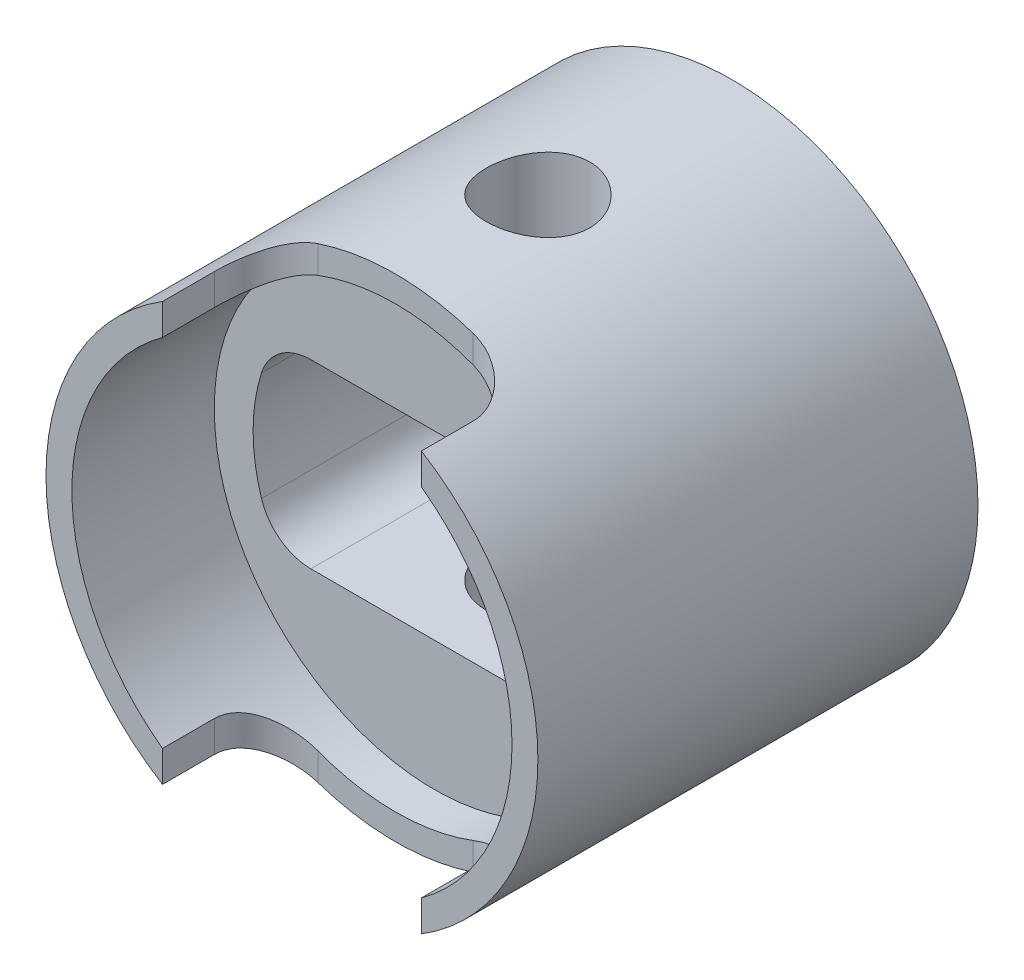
from build123d import *

# Parameters (mm, degrees)
ESQUISSE1_R             = 9.5
BASE_EXTRUSION_DEPTH    = 17
ESQUISSE2_R             = 8.5
ENL_V_MAT_EXTRU_1_DEPTH = 5.5
ESQUISSE3_R             = 2
ENL_V_MAT_EXTRU_2_DEPTH = 15
ENL_V_MAT_EXTRU_3_DEPTH = 10
CONG_1_R                = 1


with BuildPart() as part:
    # Esquisse1 → Base-Extrusion (new body)
    with BuildSketch(Plane.XY):
        Circle(ESQUISSE1_R)
    extrude(amount=BASE_EXTRUSION_DEPTH)

    # Esquisse2 → Enl_v. mat.-Extru.1 (cut)
    with BuildSketch(Plane.XY.offset(17)):
        Circle(ESQUISSE2_R)
    extrude(amount=-ENL_V_MAT_EXTRU_1_DEPTH, mode=Mode.SUBTRACT)

    # Esquisse3 → Enl_v. mat.-Extru.2 (cut, symmetric)
    with BuildSketch(Plane(origin=(0, 0, 0), x_dir=(1, 0, 0), z_dir=(0, 1, 0))):
        with Locations(Location((0, -7.5, 0), (0, 0, 270))):
            Circle(ESQUISSE3_R)
        with BuildLine():
            Line((-5, -17), (5, -17))
            Line((5, -17), (5, -15))
            ThreePointArc((5, -15), (4.414213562, -13.585786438), (3, -13))
            Line((3, -13), (-3, -13))
            ThreePointArc((-3, -13), (-4.414213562, -13.585786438), (-5, -15))
            Line((-5, -15), (-5, -17))
        make_face()
    extrude(amount=ENL_V_MAT_EXTRU_2_DEPTH, both=True, mode=Mode.SUBTRACT)

    # Esquisse4 → Enl_v. mat.-Extru.3 (cut)
    with BuildSketch(Plane.XY.offset(11.5)):
        with BuildLine():
            Line((-4.769696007, 3.5), (4.769696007, 3.5))
            ThreePointArc((4.769696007, 3.5), (5.952911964, 3.11245155), (6.67757441, 2.1))
            ThreePointArc((6.67757441, 2.1), (7, 0), (6.67757441, -2.1))
            ThreePointArc((6.67757441, -2.1), (5.952911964, -3.11245155), (4.769696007, -3.5))
            Line((4.769696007, -3.5), (-4.769696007, -3.5))
            ThreePointArc((-4.769696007, -3.5), (-5.952911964, -3.11245155), (-6.67757441, -2.1))
            ThreePointArc((-6.67757441, -2.1), (-7, 0), (-6.67757441, 2.1))
            ThreePointArc((-6.67757441, 2.1), (-5.952911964, 3.11245155), (-4.769696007, 3.5))
        make_face()
    extrude(amount=-ENL_V_MAT_EXTRU_3_DEPTH, mode=Mode.SUBTRACT)

    # Cong_1
    cong_1_edges = [part.edges().sort_by_distance(p)[0] for p in [
        (0, 3.5, 1.5),
        (0, -3.5, 1.5),
        (-5.952911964, 3.11245155, 1.5),
        (5.952911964, 3.11245155, 1.5),
        (7, 0, 1.5),
        (5.952911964, -3.11245155, 1.5),
        (-5.952911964, -3.11245155, 1.5),
        (-7, 0, 1.5),
    ]]
    fillet(cong_1_edges, radius=CONG_1_R)


solid = part.part
